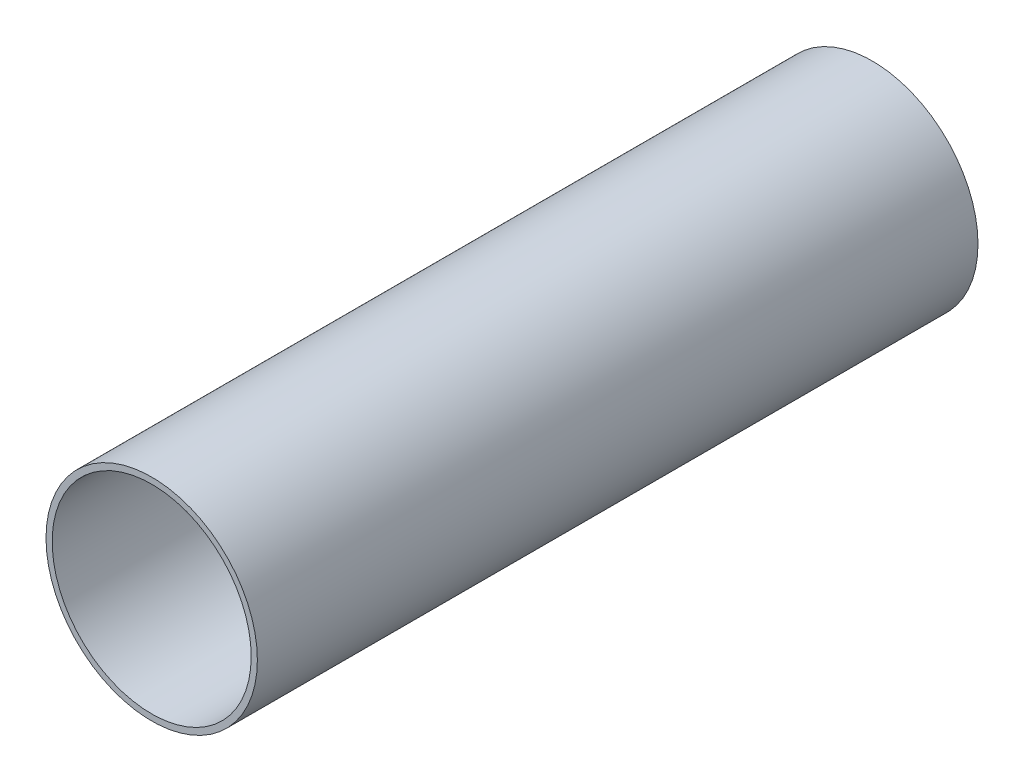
from build123d import *

# Parameters (mm, degrees)
SKETCH_1_R          = 30.065
EXTRUDE_1_DEPTH     = 205
SKETCH_2_R          = 28.31
CUT_EXTRUDE_1_DEPTH = 210.362863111


with BuildPart() as part:
    # Sketch 1 → Extrude 1 (new body)
    with BuildSketch(Plane.XY):
        with Locations(Location((0, 0, 0), (0, 0, 180))):
            Circle(SKETCH_1_R)
    extrude(amount=EXTRUDE_1_DEPTH)

    # Sketch 2 → Cut-Extrude 1 (cut, through all)
    with BuildSketch(Plane.XY.offset(205)):
        Circle(SKETCH_2_R)
    extrude(amount=-CUT_EXTRUDE_1_DEPTH, mode=Mode.SUBTRACT)


solid = part.part
